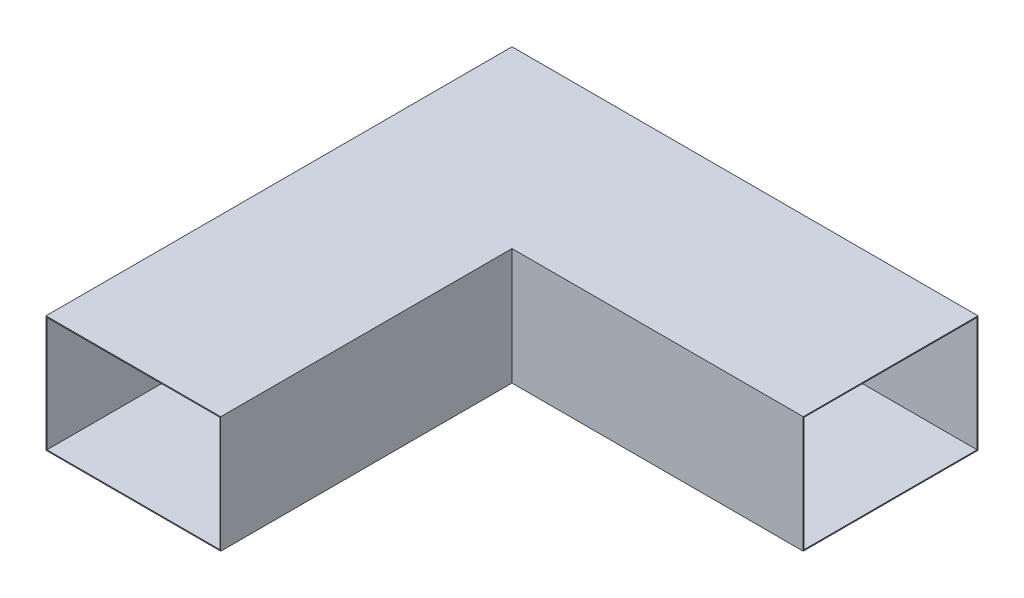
ISO-10303-21;
HEADER;
FILE_DESCRIPTION(('STEP AP214'),'2;1');
FILE_NAME('part.step','',(''),(''),'','','');
FILE_SCHEMA(('AUTOMOTIVE_DESIGN { 1 0 10303 214 1 1 1 1 }'));
ENDSEC;
DATA;
#1=APPLICATION_CONTEXT('core data for automotive mechanical design processes');
#2=APPLICATION_PROTOCOL_DEFINITION('international standard','automotive_design',2000,#1);
#3=PRODUCT_CONTEXT('',#1,'mechanical');
#4=PRODUCT('Part','Part','',(#3));
#5=PRODUCT_RELATED_PRODUCT_CATEGORY('part','',(#4));
#6=PRODUCT_DEFINITION_FORMATION('','',#4);
#7=PRODUCT_DEFINITION_CONTEXT('part definition',#1,'design');
#8=PRODUCT_DEFINITION('design','',#6,#7);
#9=PRODUCT_DEFINITION_SHAPE('','',#8);
#10=(LENGTH_UNIT() NAMED_UNIT(*) SI_UNIT(.MILLI.,.METRE.));
#11=(NAMED_UNIT(*) PLANE_ANGLE_UNIT() SI_UNIT($,.RADIAN.));
#12=(NAMED_UNIT(*) SI_UNIT($,.STERADIAN.) SOLID_ANGLE_UNIT());
#13=UNCERTAINTY_MEASURE_WITH_UNIT(LENGTH_MEASURE(1.E-05),#10,'distance_accuracy_value','');
#14=(GEOMETRIC_REPRESENTATION_CONTEXT(3) GLOBAL_UNCERTAINTY_ASSIGNED_CONTEXT((#13)) GLOBAL_UNIT_ASSIGNED_CONTEXT((#10,
#11,#12)) REPRESENTATION_CONTEXT('',''));
#15=CARTESIAN_POINT('',(0.,0.,0.));
#16=DIRECTION('',(0.,0.,1.));
#17=DIRECTION('',(1.,0.,0.));
#18=AXIS2_PLACEMENT_3D('',#15,#16,#17);
#19=CARTESIAN_POINT('',(-609.6,304.8,609.6));
#20=DIRECTION('',(0.,0.,-1.));
#21=DIRECTION('',(-1.,0.,0.));
#22=AXIS2_PLACEMENT_3D('',#19,#20,#21);
#23=PLANE('',#22);
#24=DIRECTION('',(1.,0.,0.));
#25=VECTOR('',#24,1.);
#26=CARTESIAN_POINT('',(-609.6,0.,609.6));
#27=LINE('',#26,#25);
#28=CARTESIAN_POINT('',(-609.6,0.,609.6));
#29=VERTEX_POINT('',#28);
#30=CARTESIAN_POINT('',(-152.4,0.,609.6));
#31=VERTEX_POINT('',#30);
#32=EDGE_CURVE('E205',#29,#31,#27,.T.);
#33=ORIENTED_EDGE('',*,*,#32,.T.);
#34=DIRECTION('',(0.,1.,0.));
#35=VECTOR('',#34,1.);
#36=CARTESIAN_POINT('',(-152.4,0.,609.6));
#37=LINE('',#36,#35);
#38=CARTESIAN_POINT('',(-152.4,304.8,609.6));
#39=VERTEX_POINT('',#38);
#40=EDGE_CURVE('E180',#31,#39,#37,.T.);
#41=ORIENTED_EDGE('',*,*,#40,.T.);
#42=DIRECTION('',(1.,0.,0.));
#43=VECTOR('',#42,1.);
#44=CARTESIAN_POINT('',(-609.6,304.8,609.6));
#45=LINE('',#44,#43);
#46=CARTESIAN_POINT('',(-609.6,304.8,609.6));
#47=VERTEX_POINT('',#46);
#48=EDGE_CURVE('E194',#47,#39,#45,.T.);
#49=ORIENTED_EDGE('',*,*,#48,.F.);
#50=DIRECTION('',(0.,-1.,0.));
#51=VECTOR('',#50,1.);
#52=CARTESIAN_POINT('',(-609.6,304.8,609.6));
#53=LINE('',#52,#51);
#54=EDGE_CURVE('E11',#47,#29,#53,.T.);
#55=ORIENTED_EDGE('',*,*,#54,.T.);
#56=EDGE_LOOP('',(#33,#41,#49,#55));
#57=FACE_BOUND('',#56,.T.);
#58=DIRECTION('',(1.,0.,0.));
#59=VECTOR('',#58,1.);
#60=CARTESIAN_POINT('',(-609.6,2.53999999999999,609.6));
#61=LINE('',#60,#59);
#62=CARTESIAN_POINT('',(-607.06,2.54,609.6));
#63=VERTEX_POINT('',#62);
#64=CARTESIAN_POINT('',(-154.94,2.54,609.6));
#65=VERTEX_POINT('',#64);
#66=EDGE_CURVE('E139',#63,#65,#61,.T.);
#67=ORIENTED_EDGE('',*,*,#66,.F.);
#68=DIRECTION('',(0.,-1.,0.));
#69=VECTOR('',#68,1.);
#70=CARTESIAN_POINT('',(-607.06,304.8,609.6));
#71=LINE('',#70,#69);
#72=CARTESIAN_POINT('',(-607.06,302.26,609.6));
#73=VERTEX_POINT('',#72);
#74=EDGE_CURVE('E138',#73,#63,#71,.T.);
#75=ORIENTED_EDGE('',*,*,#74,.F.);
#76=DIRECTION('',(1.,0.,0.));
#77=VECTOR('',#76,1.);
#78=CARTESIAN_POINT('',(-609.6,302.26,609.6));
#79=LINE('',#78,#77);
#80=CARTESIAN_POINT('',(-154.94,302.26,609.6));
#81=VERTEX_POINT('',#80);
#82=EDGE_CURVE('E146',#73,#81,#79,.T.);
#83=ORIENTED_EDGE('',*,*,#82,.T.);
#84=DIRECTION('',(0.,1.,0.));
#85=VECTOR('',#84,1.);
#86=CARTESIAN_POINT('',(-154.94,304.8,609.6));
#87=LINE('',#86,#85);
#88=EDGE_CURVE('E160',#65,#81,#87,.T.);
#89=ORIENTED_EDGE('',*,*,#88,.F.);
#90=EDGE_LOOP('',(#67,#75,#83,#89));
#91=FACE_BOUND('',#90,.T.);
#92=ADVANCED_FACE('F32',(#57,#91),#23,.F.);
#93=CARTESIAN_POINT('',(-609.6,304.8,-609.6));
#94=DIRECTION('',(1.,0.,0.));
#95=DIRECTION('',(0.,0.,-1.));
#96=AXIS2_PLACEMENT_3D('',#93,#94,#95);
#97=PLANE('',#96);
#98=DIRECTION('',(0.,0.,1.));
#99=VECTOR('',#98,1.);
#100=CARTESIAN_POINT('',(-609.6,0.,-609.6));
#101=LINE('',#100,#99);
#102=CARTESIAN_POINT('',(-609.6,0.,-609.6));
#103=VERTEX_POINT('',#102);
#104=EDGE_CURVE('E186',#103,#29,#101,.T.);
#105=ORIENTED_EDGE('',*,*,#104,.T.);
#106=ORIENTED_EDGE('',*,*,#54,.F.);
#107=DIRECTION('',(0.,0.,1.));
#108=VECTOR('',#107,1.);
#109=CARTESIAN_POINT('',(-609.6,304.8,-609.6));
#110=LINE('',#109,#108);
#111=CARTESIAN_POINT('',(-609.6,304.8,-609.6));
#112=VERTEX_POINT('',#111);
#113=EDGE_CURVE('E191',#112,#47,#110,.T.);
#114=ORIENTED_EDGE('',*,*,#113,.F.);
#115=DIRECTION('',(0.,-1.,0.));
#116=VECTOR('',#115,1.);
#117=CARTESIAN_POINT('',(-609.6,304.8,-609.6));
#118=LINE('',#117,#116);
#119=EDGE_CURVE('E202',#112,#103,#118,.T.);
#120=ORIENTED_EDGE('',*,*,#119,.T.);
#121=EDGE_LOOP('',(#105,#106,#114,#120));
#122=FACE_BOUND('',#121,.T.);
#123=ADVANCED_FACE('F34',(#122),#97,.F.);
#124=CARTESIAN_POINT('',(609.6,304.8,-609.6));
#125=DIRECTION('',(-1.,0.,0.));
#126=DIRECTION('',(0.,0.,1.));
#127=AXIS2_PLACEMENT_3D('',#124,#125,#126);
#128=PLANE('',#127);
#129=DIRECTION('',(0.,1.,0.));
#130=VECTOR('',#129,1.);
#131=CARTESIAN_POINT('',(609.6,0.,-154.94));
#132=LINE('',#131,#130);
#133=CARTESIAN_POINT('',(609.6,2.54,-154.94));
#134=VERTEX_POINT('',#133);
#135=CARTESIAN_POINT('',(609.6,302.26,-154.94));
#136=VERTEX_POINT('',#135);
#137=EDGE_CURVE('E143',#134,#136,#132,.T.);
#138=ORIENTED_EDGE('',*,*,#137,.T.);
#139=DIRECTION('',(0.,0.,-1.));
#140=VECTOR('',#139,1.);
#141=CARTESIAN_POINT('',(609.6,302.26,-609.6));
#142=LINE('',#141,#140);
#143=CARTESIAN_POINT('',(609.6,302.26,-607.06));
#144=VERTEX_POINT('',#143);
#145=EDGE_CURVE('E149',#136,#144,#142,.T.);
#146=ORIENTED_EDGE('',*,*,#145,.T.);
#147=DIRECTION('',(0.,-1.,0.));
#148=VECTOR('',#147,1.);
#149=CARTESIAN_POINT('',(609.6,304.8,-607.06));
#150=LINE('',#149,#148);
#151=CARTESIAN_POINT('',(609.6,2.54,-607.06));
#152=VERTEX_POINT('',#151);
#153=EDGE_CURVE('E134',#144,#152,#150,.T.);
#154=ORIENTED_EDGE('',*,*,#153,.T.);
#155=DIRECTION('',(0.,0.,-1.));
#156=VECTOR('',#155,1.);
#157=CARTESIAN_POINT('',(609.6,2.53999999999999,-609.6));
#158=LINE('',#157,#156);
#159=EDGE_CURVE('E127',#134,#152,#158,.T.);
#160=ORIENTED_EDGE('',*,*,#159,.F.);
#161=EDGE_LOOP('',(#138,#146,#154,#160));
#162=FACE_BOUND('',#161,.T.);
#163=DIRECTION('',(0.,0.,-1.));
#164=VECTOR('',#163,1.);
#165=CARTESIAN_POINT('',(609.6,304.8,-609.6));
#166=LINE('',#165,#164);
#167=CARTESIAN_POINT('',(609.6,304.8,-152.4));
#168=VERTEX_POINT('',#167);
#169=CARTESIAN_POINT('',(609.6,304.8,-609.6));
#170=VERTEX_POINT('',#169);
#171=EDGE_CURVE('E198',#168,#170,#166,.T.);
#172=ORIENTED_EDGE('',*,*,#171,.F.);
#173=DIRECTION('',(0.,1.,0.));
#174=VECTOR('',#173,1.);
#175=CARTESIAN_POINT('',(609.6,0.,-152.4));
#176=LINE('',#175,#174);
#177=CARTESIAN_POINT('',(609.6,0.,-152.4));
#178=VERTEX_POINT('',#177);
#179=EDGE_CURVE('E187',#178,#168,#176,.T.);
#180=ORIENTED_EDGE('',*,*,#179,.F.);
#181=DIRECTION('',(0.,0.,-1.));
#182=VECTOR('',#181,1.);
#183=CARTESIAN_POINT('',(609.6,0.,-609.6));
#184=LINE('',#183,#182);
#185=CARTESIAN_POINT('',(609.6,0.,-609.6));
#186=VERTEX_POINT('',#185);
#187=EDGE_CURVE('E208',#178,#186,#184,.T.);
#188=ORIENTED_EDGE('',*,*,#187,.T.);
#189=DIRECTION('',(0.,-1.,0.));
#190=VECTOR('',#189,1.);
#191=CARTESIAN_POINT('',(609.6,304.8,-609.6));
#192=LINE('',#191,#190);
#193=EDGE_CURVE('E40',#170,#186,#192,.T.);
#194=ORIENTED_EDGE('',*,*,#193,.F.);
#195=EDGE_LOOP('',(#172,#180,#188,#194));
#196=FACE_BOUND('',#195,.T.);
#197=ADVANCED_FACE('F233',(#162,#196),#128,.F.);
#198=CARTESIAN_POINT('',(-609.6,304.8,-609.6));
#199=DIRECTION('',(0.,0.,1.));
#200=DIRECTION('',(1.,0.,0.));
#201=AXIS2_PLACEMENT_3D('',#198,#199,#200);
#202=PLANE('',#201);
#203=DIRECTION('',(-1.,0.,0.));
#204=VECTOR('',#203,1.);
#205=CARTESIAN_POINT('',(-609.6,0.,-609.6));
#206=LINE('',#205,#204);
#207=EDGE_CURVE('E195',#186,#103,#206,.T.);
#208=ORIENTED_EDGE('',*,*,#207,.T.);
#209=ORIENTED_EDGE('',*,*,#119,.F.);
#210=DIRECTION('',(-1.,0.,0.));
#211=VECTOR('',#210,1.);
#212=CARTESIAN_POINT('',(-609.6,304.8,-609.6));
#213=LINE('',#212,#211);
#214=EDGE_CURVE('E200',#170,#112,#213,.T.);
#215=ORIENTED_EDGE('',*,*,#214,.F.);
#216=ORIENTED_EDGE('',*,*,#193,.T.);
#217=EDGE_LOOP('',(#208,#209,#215,#216));
#218=FACE_BOUND('',#217,.T.);
#219=ADVANCED_FACE('F217',(#218),#202,.F.);
#220=CARTESIAN_POINT('',(0.,304.8,0.));
#221=DIRECTION('',(0.,1.,0.));
#222=DIRECTION('',(0.,0.,1.));
#223=AXIS2_PLACEMENT_3D('',#220,#221,#222);
#224=PLANE('',#223);
#225=DIRECTION('',(0.,0.,1.));
#226=VECTOR('',#225,1.);
#227=CARTESIAN_POINT('',(-152.4,304.8,-152.4));
#228=LINE('',#227,#226);
#229=CARTESIAN_POINT('',(-152.4,304.8,-152.4));
#230=VERTEX_POINT('',#229);
#231=EDGE_CURVE('E161',#230,#39,#228,.T.);
#232=ORIENTED_EDGE('',*,*,#231,.F.);
#233=DIRECTION('',(-1.,0.,0.));
#234=VECTOR('',#233,1.);
#235=CARTESIAN_POINT('',(-152.4,304.8,-152.4));
#236=LINE('',#235,#234);
#237=EDGE_CURVE('E177',#168,#230,#236,.T.);
#238=ORIENTED_EDGE('',*,*,#237,.F.);
#239=ORIENTED_EDGE('',*,*,#171,.T.);
#240=ORIENTED_EDGE('',*,*,#214,.T.);
#241=ORIENTED_EDGE('',*,*,#113,.T.);
#242=ORIENTED_EDGE('',*,*,#48,.T.);
#243=EDGE_LOOP('',(#232,#238,#239,#240,#241,#242));
#244=FACE_BOUND('',#243,.T.);
#245=ADVANCED_FACE('F230',(#244),#224,.T.);
#246=CARTESIAN_POINT('',(0.,0.,0.));
#247=DIRECTION('',(0.,1.,0.));
#248=DIRECTION('',(0.,0.,1.));
#249=AXIS2_PLACEMENT_3D('',#246,#247,#248);
#250=PLANE('',#249);
#251=DIRECTION('',(-1.,0.,0.));
#252=VECTOR('',#251,1.);
#253=CARTESIAN_POINT('',(-152.4,0.,-152.4));
#254=LINE('',#253,#252);
#255=CARTESIAN_POINT('',(-152.4,0.,-152.4));
#256=VERTEX_POINT('',#255);
#257=EDGE_CURVE('E176',#178,#256,#254,.T.);
#258=ORIENTED_EDGE('',*,*,#257,.T.);
#259=DIRECTION('',(0.,0.,1.));
#260=VECTOR('',#259,1.);
#261=CARTESIAN_POINT('',(-152.4,0.,-152.4));
#262=LINE('',#261,#260);
#263=EDGE_CURVE('E173',#256,#31,#262,.T.);
#264=ORIENTED_EDGE('',*,*,#263,.T.);
#265=ORIENTED_EDGE('',*,*,#32,.F.);
#266=ORIENTED_EDGE('',*,*,#104,.F.);
#267=ORIENTED_EDGE('',*,*,#207,.F.);
#268=ORIENTED_EDGE('',*,*,#187,.F.);
#269=EDGE_LOOP('',(#258,#264,#265,#266,#267,#268));
#270=FACE_BOUND('',#269,.T.);
#271=ADVANCED_FACE('F224',(#270),#250,.F.);
#272=CARTESIAN_POINT('',(-152.4,0.,-152.4));
#273=DIRECTION('',(-1.,0.,0.));
#274=DIRECTION('',(0.,0.,1.));
#275=AXIS2_PLACEMENT_3D('',#272,#273,#274);
#276=PLANE('',#275);
#277=ORIENTED_EDGE('',*,*,#231,.T.);
#278=ORIENTED_EDGE('',*,*,#40,.F.);
#279=ORIENTED_EDGE('',*,*,#263,.F.);
#280=DIRECTION('',(0.,1.,0.));
#281=VECTOR('',#280,1.);
#282=CARTESIAN_POINT('',(-152.4,0.,-152.4));
#283=LINE('',#282,#281);
#284=EDGE_CURVE('E184',#256,#230,#283,.T.);
#285=ORIENTED_EDGE('',*,*,#284,.T.);
#286=EDGE_LOOP('',(#277,#278,#279,#285));
#287=FACE_BOUND('',#286,.T.);
#288=ADVANCED_FACE('F240',(#287),#276,.F.);
#289=CARTESIAN_POINT('',(-152.4,0.,-152.4));
#290=DIRECTION('',(0.,0.,-1.));
#291=DIRECTION('',(-1.,0.,0.));
#292=AXIS2_PLACEMENT_3D('',#289,#290,#291);
#293=PLANE('',#292);
#294=ORIENTED_EDGE('',*,*,#237,.T.);
#295=ORIENTED_EDGE('',*,*,#284,.F.);
#296=ORIENTED_EDGE('',*,*,#257,.F.);
#297=ORIENTED_EDGE('',*,*,#179,.T.);
#298=EDGE_LOOP('',(#294,#295,#296,#297));
#299=FACE_BOUND('',#298,.T.);
#300=ADVANCED_FACE('F235',(#299),#293,.F.);
#301=CARTESIAN_POINT('',(-607.06,304.8,-609.6));
#302=DIRECTION('',(1.,0.,0.));
#303=DIRECTION('',(0.,0.,-1.));
#304=AXIS2_PLACEMENT_3D('',#301,#302,#303);
#305=PLANE('',#304);
#306=DIRECTION('',(0.,0.,1.));
#307=VECTOR('',#306,1.);
#308=CARTESIAN_POINT('',(-607.06,2.53999999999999,-609.6));
#309=LINE('',#308,#307);
#310=CARTESIAN_POINT('',(-607.06,2.54,-607.06));
#311=VERTEX_POINT('',#310);
#312=EDGE_CURVE('E124',#311,#63,#309,.T.);
#313=ORIENTED_EDGE('',*,*,#312,.F.);
#314=DIRECTION('',(0.,-1.,0.));
#315=VECTOR('',#314,1.);
#316=CARTESIAN_POINT('',(-607.06,304.8,-607.06));
#317=LINE('',#316,#315);
#318=CARTESIAN_POINT('',(-607.06,302.26,-607.06));
#319=VERTEX_POINT('',#318);
#320=EDGE_CURVE('E130',#319,#311,#317,.T.);
#321=ORIENTED_EDGE('',*,*,#320,.F.);
#322=DIRECTION('',(0.,0.,1.));
#323=VECTOR('',#322,1.);
#324=CARTESIAN_POINT('',(-607.06,302.26,-609.6));
#325=LINE('',#324,#323);
#326=EDGE_CURVE('E47',#319,#73,#325,.T.);
#327=ORIENTED_EDGE('',*,*,#326,.T.);
#328=ORIENTED_EDGE('',*,*,#74,.T.);
#329=EDGE_LOOP('',(#313,#321,#327,#328));
#330=FACE_BOUND('',#329,.T.);
#331=ADVANCED_FACE('F136',(#330),#305,.T.);
#332=CARTESIAN_POINT('',(-609.6,304.8,-607.06));
#333=DIRECTION('',(0.,0.,1.));
#334=DIRECTION('',(1.,0.,0.));
#335=AXIS2_PLACEMENT_3D('',#332,#333,#334);
#336=PLANE('',#335);
#337=DIRECTION('',(-1.,0.,0.));
#338=VECTOR('',#337,1.);
#339=CARTESIAN_POINT('',(-609.6,2.53999999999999,-607.06));
#340=LINE('',#339,#338);
#341=EDGE_CURVE('E55',#152,#311,#340,.T.);
#342=ORIENTED_EDGE('',*,*,#341,.F.);
#343=ORIENTED_EDGE('',*,*,#153,.F.);
#344=DIRECTION('',(-1.,0.,0.));
#345=VECTOR('',#344,1.);
#346=CARTESIAN_POINT('',(-609.6,302.26,-607.06));
#347=LINE('',#346,#345);
#348=EDGE_CURVE('E133',#144,#319,#347,.T.);
#349=ORIENTED_EDGE('',*,*,#348,.T.);
#350=ORIENTED_EDGE('',*,*,#320,.T.);
#351=EDGE_LOOP('',(#342,#343,#349,#350));
#352=FACE_BOUND('',#351,.T.);
#353=ADVANCED_FACE('F131',(#352),#336,.T.);
#354=CARTESIAN_POINT('',(0.,302.26,0.));
#355=DIRECTION('',(0.,1.,0.));
#356=DIRECTION('',(0.,0.,1.));
#357=AXIS2_PLACEMENT_3D('',#354,#355,#356);
#358=PLANE('',#357);
#359=DIRECTION('',(0.,0.,1.));
#360=VECTOR('',#359,1.);
#361=CARTESIAN_POINT('',(-154.94,302.26,0.));
#362=LINE('',#361,#360);
#363=CARTESIAN_POINT('',(-154.94,302.26,-154.94));
#364=VERTEX_POINT('',#363);
#365=EDGE_CURVE('E150',#364,#81,#362,.T.);
#366=ORIENTED_EDGE('',*,*,#365,.T.);
#367=ORIENTED_EDGE('',*,*,#82,.F.);
#368=ORIENTED_EDGE('',*,*,#326,.F.);
#369=ORIENTED_EDGE('',*,*,#348,.F.);
#370=ORIENTED_EDGE('',*,*,#145,.F.);
#371=DIRECTION('',(-1.,0.,0.));
#372=VECTOR('',#371,1.);
#373=CARTESIAN_POINT('',(0.,302.26,-154.94));
#374=LINE('',#373,#372);
#375=EDGE_CURVE('E152',#136,#364,#374,.T.);
#376=ORIENTED_EDGE('',*,*,#375,.T.);
#377=EDGE_LOOP('',(#366,#367,#368,#369,#370,#376));
#378=FACE_BOUND('',#377,.T.);
#379=ADVANCED_FACE('F307',(#378),#358,.F.);
#380=CARTESIAN_POINT('',(0.,2.54,0.));
#381=DIRECTION('',(0.,1.,0.));
#382=DIRECTION('',(0.,0.,1.));
#383=AXIS2_PLACEMENT_3D('',#380,#381,#382);
#384=PLANE('',#383);
#385=DIRECTION('',(-1.,0.,0.));
#386=VECTOR('',#385,1.);
#387=CARTESIAN_POINT('',(0.,2.54,-154.94));
#388=LINE('',#387,#386);
#389=CARTESIAN_POINT('',(-154.94,2.54,-154.94));
#390=VERTEX_POINT('',#389);
#391=EDGE_CURVE('E156',#134,#390,#388,.T.);
#392=ORIENTED_EDGE('',*,*,#391,.F.);
#393=ORIENTED_EDGE('',*,*,#159,.T.);
#394=ORIENTED_EDGE('',*,*,#341,.T.);
#395=ORIENTED_EDGE('',*,*,#312,.T.);
#396=ORIENTED_EDGE('',*,*,#66,.T.);
#397=DIRECTION('',(0.,0.,1.));
#398=VECTOR('',#397,1.);
#399=CARTESIAN_POINT('',(-154.94,2.54,0.));
#400=LINE('',#399,#398);
#401=EDGE_CURVE('E155',#390,#65,#400,.T.);
#402=ORIENTED_EDGE('',*,*,#401,.F.);
#403=EDGE_LOOP('',(#392,#393,#394,#395,#396,#402));
#404=FACE_BOUND('',#403,.T.);
#405=ADVANCED_FACE('F121',(#404),#384,.T.);
#406=CARTESIAN_POINT('',(-154.94,0.,-152.4));
#407=DIRECTION('',(-1.,0.,0.));
#408=DIRECTION('',(0.,0.,1.));
#409=AXIS2_PLACEMENT_3D('',#406,#407,#408);
#410=PLANE('',#409);
#411=ORIENTED_EDGE('',*,*,#365,.F.);
#412=DIRECTION('',(0.,1.,0.));
#413=VECTOR('',#412,1.);
#414=CARTESIAN_POINT('',(-154.94,0.,-154.94));
#415=LINE('',#414,#413);
#416=EDGE_CURVE('E140',#390,#364,#415,.T.);
#417=ORIENTED_EDGE('',*,*,#416,.F.);
#418=ORIENTED_EDGE('',*,*,#401,.T.);
#419=ORIENTED_EDGE('',*,*,#88,.T.);
#420=EDGE_LOOP('',(#411,#417,#418,#419));
#421=FACE_BOUND('',#420,.T.);
#422=ADVANCED_FACE('F325',(#421),#410,.T.);
#423=CARTESIAN_POINT('',(-152.4,0.,-154.94));
#424=DIRECTION('',(0.,0.,-1.));
#425=DIRECTION('',(-1.,0.,0.));
#426=AXIS2_PLACEMENT_3D('',#423,#424,#425);
#427=PLANE('',#426);
#428=ORIENTED_EDGE('',*,*,#375,.F.);
#429=ORIENTED_EDGE('',*,*,#137,.F.);
#430=ORIENTED_EDGE('',*,*,#391,.T.);
#431=ORIENTED_EDGE('',*,*,#416,.T.);
#432=EDGE_LOOP('',(#428,#429,#430,#431));
#433=FACE_BOUND('',#432,.T.);
#434=ADVANCED_FACE('F334',(#433),#427,.T.);
#435=CLOSED_SHELL('',(#92,#123,#197,#219,#245,#271,#288,#300,#331,#353,#379,#405,#422,#434));
#436=MANIFOLD_SOLID_BREP('B2',#435);
#437=ADVANCED_BREP_SHAPE_REPRESENTATION('',(#18,#436),#14);
#438=SHAPE_DEFINITION_REPRESENTATION(#9,#437);
ENDSEC;
END-ISO-10303-21;
